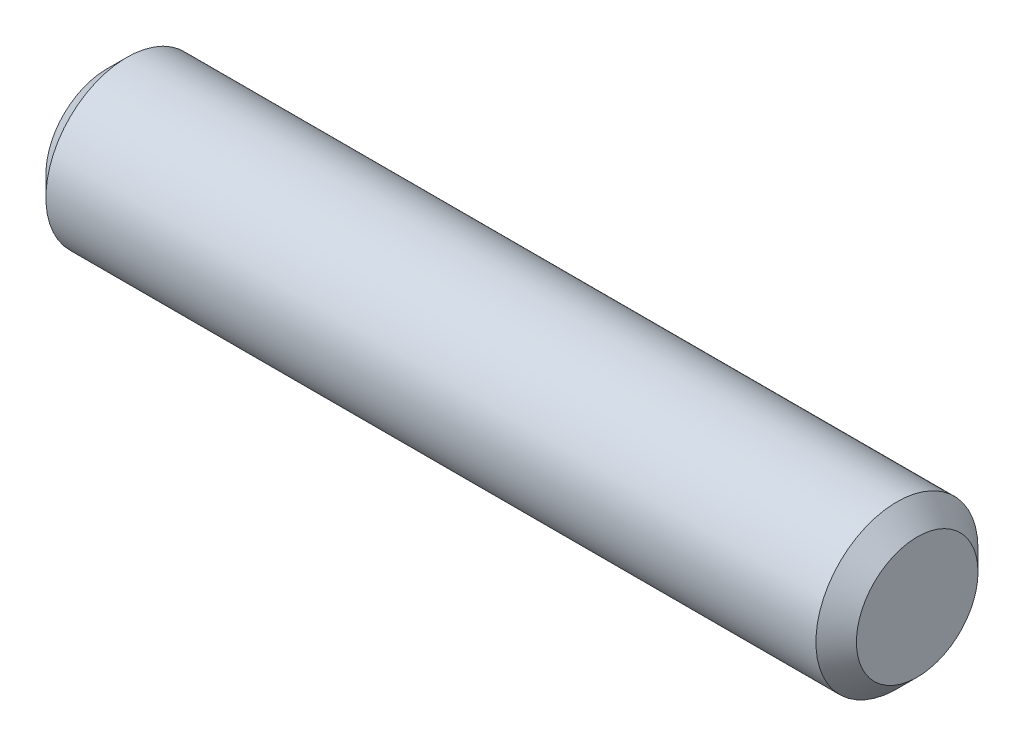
ISO-10303-21;
HEADER;
FILE_DESCRIPTION(('STEP AP214'),'2;1');
FILE_NAME('part.step','',(''),(''),'','','');
FILE_SCHEMA(('AUTOMOTIVE_DESIGN { 1 0 10303 214 1 1 1 1 }'));
ENDSEC;
DATA;
#1=APPLICATION_CONTEXT('core data for automotive mechanical design processes');
#2=APPLICATION_PROTOCOL_DEFINITION('international standard','automotive_design',2000,#1);
#3=PRODUCT_CONTEXT('',#1,'mechanical');
#4=PRODUCT('Part','Part','',(#3));
#5=PRODUCT_RELATED_PRODUCT_CATEGORY('part','',(#4));
#6=PRODUCT_DEFINITION_FORMATION('','',#4);
#7=PRODUCT_DEFINITION_CONTEXT('part definition',#1,'design');
#8=PRODUCT_DEFINITION('design','',#6,#7);
#9=PRODUCT_DEFINITION_SHAPE('','',#8);
#10=(LENGTH_UNIT() NAMED_UNIT(*) SI_UNIT(.MILLI.,.METRE.));
#11=(NAMED_UNIT(*) PLANE_ANGLE_UNIT() SI_UNIT($,.RADIAN.));
#12=(NAMED_UNIT(*) SI_UNIT($,.STERADIAN.) SOLID_ANGLE_UNIT());
#13=UNCERTAINTY_MEASURE_WITH_UNIT(LENGTH_MEASURE(1.E-05),#10,'distance_accuracy_value','');
#14=(GEOMETRIC_REPRESENTATION_CONTEXT(3) GLOBAL_UNCERTAINTY_ASSIGNED_CONTEXT((#13)) GLOBAL_UNIT_ASSIGNED_CONTEXT((#10,
#11,#12)) REPRESENTATION_CONTEXT('',''));
#15=CARTESIAN_POINT('',(0.,0.,0.));
#16=DIRECTION('',(0.,0.,1.));
#17=DIRECTION('',(1.,0.,0.));
#18=AXIS2_PLACEMENT_3D('',#15,#16,#17);
#19=CARTESIAN_POINT('',(20.,0.,0.));
#20=DIRECTION('',(-1.,0.,0.));
#21=DIRECTION('',(0.,0.,1.));
#22=AXIS2_PLACEMENT_3D('',#19,#20,#21);
#23=CYLINDRICAL_SURFACE('',#22,2.);
#24=CARTESIAN_POINT('',(0.499999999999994,0.,0.));
#25=DIRECTION('',(1.,0.,0.));
#26=DIRECTION('',(0.,0.,-1.));
#27=AXIS2_PLACEMENT_3D('',#24,#25,#26);
#28=CIRCLE('',#27,2.);
#29=CARTESIAN_POINT('',(0.499999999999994,0.,-2.));
#30=VERTEX_POINT('',#29);
#31=EDGE_CURVE('E39',#30,#30,#28,.T.);
#32=ORIENTED_EDGE('',*,*,#31,.T.);
#33=EDGE_LOOP('',(#32));
#34=FACE_BOUND('',#33,.T.);
#35=CARTESIAN_POINT('',(19.5,0.,0.));
#36=DIRECTION('',(1.,0.,0.));
#37=DIRECTION('',(0.,0.,-1.));
#38=AXIS2_PLACEMENT_3D('',#35,#36,#37);
#39=CIRCLE('',#38,2.);
#40=CARTESIAN_POINT('',(19.5,0.,-2.));
#41=VERTEX_POINT('',#40);
#42=EDGE_CURVE('E43',#41,#41,#39,.F.);
#43=ORIENTED_EDGE('',*,*,#42,.T.);
#44=EDGE_LOOP('',(#43));
#45=FACE_BOUND('',#44,.T.);
#46=ADVANCED_FACE('F28',(#34,#45),#23,.T.);
#47=CARTESIAN_POINT('',(20.,0.,0.));
#48=DIRECTION('',(1.,0.,0.));
#49=DIRECTION('',(0.,0.,-1.));
#50=AXIS2_PLACEMENT_3D('',#47,#48,#49);
#51=PLANE('',#50);
#52=CARTESIAN_POINT('',(20.,0.,0.));
#53=DIRECTION('',(1.,0.,0.));
#54=DIRECTION('',(0.,0.,-1.));
#55=AXIS2_PLACEMENT_3D('',#52,#53,#54);
#56=CIRCLE('',#55,1.5);
#57=CARTESIAN_POINT('',(20.,0.,-1.5));
#58=VERTEX_POINT('',#57);
#59=EDGE_CURVE('E10',#58,#58,#56,.T.);
#60=ORIENTED_EDGE('',*,*,#59,.T.);
#61=EDGE_LOOP('',(#60));
#62=FACE_BOUND('',#61,.T.);
#63=ADVANCED_FACE('F59',(#62),#51,.T.);
#64=CARTESIAN_POINT('',(0.,0.,0.));
#65=DIRECTION('',(1.,0.,0.));
#66=DIRECTION('',(0.,0.,-1.));
#67=AXIS2_PLACEMENT_3D('',#64,#65,#66);
#68=PLANE('',#67);
#69=CARTESIAN_POINT('',(0.,0.,0.));
#70=DIRECTION('',(1.,0.,0.));
#71=DIRECTION('',(0.,0.,-1.));
#72=AXIS2_PLACEMENT_3D('',#69,#70,#71);
#73=CIRCLE('',#72,1.5);
#74=CARTESIAN_POINT('',(0.,0.,-1.5));
#75=VERTEX_POINT('',#74);
#76=EDGE_CURVE('E35',#75,#75,#73,.F.);
#77=ORIENTED_EDGE('',*,*,#76,.T.);
#78=EDGE_LOOP('',(#77));
#79=FACE_BOUND('',#78,.T.);
#80=ADVANCED_FACE('F56',(#79),#68,.F.);
#81=CARTESIAN_POINT('',(0.499999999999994,0.,0.));
#82=DIRECTION('',(1.,0.,0.));
#83=DIRECTION('',(0.,0.,-1.));
#84=AXIS2_PLACEMENT_3D('',#81,#82,#83);
#85=CONICAL_SURFACE('',#84,2.,0.785398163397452);
#86=ORIENTED_EDGE('',*,*,#76,.F.);
#87=EDGE_LOOP('',(#86));
#88=FACE_BOUND('',#87,.T.);
#89=ORIENTED_EDGE('',*,*,#31,.F.);
#90=EDGE_LOOP('',(#89));
#91=FACE_BOUND('',#90,.T.);
#92=ADVANCED_FACE('F52',(#88,#91),#85,.T.);
#93=CARTESIAN_POINT('',(20.,0.,0.));
#94=DIRECTION('',(-1.,0.,0.));
#95=DIRECTION('',(0.,0.,1.));
#96=AXIS2_PLACEMENT_3D('',#93,#94,#95);
#97=CONICAL_SURFACE('',#96,1.5,0.785398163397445);
#98=ORIENTED_EDGE('',*,*,#42,.F.);
#99=EDGE_LOOP('',(#98));
#100=FACE_BOUND('',#99,.T.);
#101=ORIENTED_EDGE('',*,*,#59,.F.);
#102=EDGE_LOOP('',(#101));
#103=FACE_BOUND('',#102,.T.);
#104=ADVANCED_FACE('F30',(#100,#103),#97,.T.);
#105=CLOSED_SHELL('',(#46,#63,#80,#92,#104));
#106=MANIFOLD_SOLID_BREP('B2',#105);
#107=ADVANCED_BREP_SHAPE_REPRESENTATION('',(#18,#106),#14);
#108=SHAPE_DEFINITION_REPRESENTATION(#9,#107);
ENDSEC;
END-ISO-10303-21;
